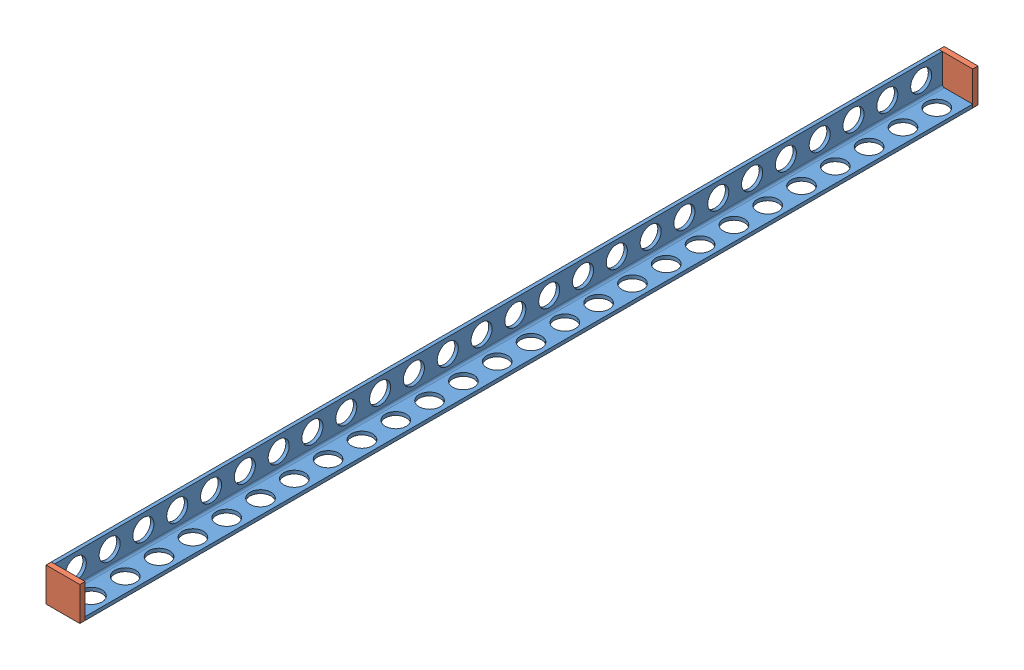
SolidWorks assembly L BEAM.SLDASM, configuration Default (file format 4400). Lengths in mm.
Overall size (80 80 2125).
3 component instances, 2 part files, 6 mates.
Components (placement in the parent):
- L BEAM-1: L BEAM.SLDPRT [Default] at origin size (80 80 2100)
- ENDPLATE-1: ENDPLATE.SLDPRT [Default] at (-40 0 1050) size (80 80 12.5)
- ENDPLATE-2: ENDPLATE.SLDPRT [Default] at (-40 0 -1062.5) size (80 80 12.5)
Mates (geometry in assembly coordinates):
- Coincident1: coincident anti-aligned: plane of L BEAM-1 through (-40 0 1050) normal (0 0 1); plane of ENDPLATE-1 through (-40 80 1050) normal (0 0 -1)
- Coincident2: coincident aligned: plane of L BEAM-1 through (-40 80 1050) normal (-1 0 0); plane of ENDPLATE-1 through (-40 0 1062.5) normal (-1 0 0)
- Coincident3: coincident aligned: plane of L BEAM-1 through (-40 0 1050) normal (0 -1 0); plane of ENDPLATE-1 through (-40 0 1062.5) normal (0 -1 0)
- Coincident4: coincident anti-aligned: plane of L BEAM-1 through (-40 0 -1050) normal (0 0 -1); plane of ENDPLATE-2 through (-40 80 -1050) normal (0 0 1)
- Coincident5: coincident aligned: plane of L BEAM-1 through (-40 80 1050) normal (-1 0 0); plane of ENDPLATE-2 through (-40 0 -1050) normal (-1 0 0)
- Coincident6: coincident aligned: plane of L BEAM-1 through (-40 0 1050) normal (0 -1 0); plane of ENDPLATE-2 through (-40 0 -1050) normal (0 -1 0)
